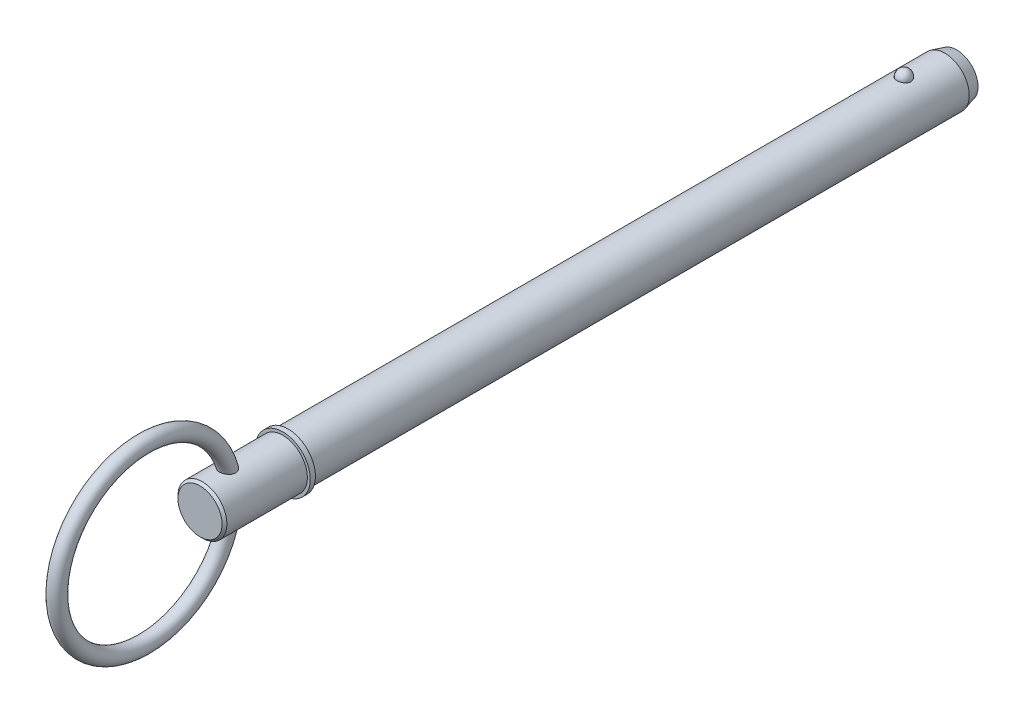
ISO-10303-21;
HEADER;
FILE_DESCRIPTION(('STEP AP214'),'2;1');
FILE_NAME('part.step','',(''),(''),'','','');
FILE_SCHEMA(('AUTOMOTIVE_DESIGN { 1 0 10303 214 1 1 1 1 }'));
ENDSEC;
DATA;
#1=APPLICATION_CONTEXT('core data for automotive mechanical design processes');
#2=APPLICATION_PROTOCOL_DEFINITION('international standard','automotive_design',2000,#1);
#3=PRODUCT_CONTEXT('',#1,'mechanical');
#4=PRODUCT('Part','Part','',(#3));
#5=PRODUCT_RELATED_PRODUCT_CATEGORY('part','',(#4));
#6=PRODUCT_DEFINITION_FORMATION('','',#4);
#7=PRODUCT_DEFINITION_CONTEXT('part definition',#1,'design');
#8=PRODUCT_DEFINITION('design','',#6,#7);
#9=PRODUCT_DEFINITION_SHAPE('','',#8);
#10=(LENGTH_UNIT() NAMED_UNIT(*) SI_UNIT(.MILLI.,.METRE.));
#11=(NAMED_UNIT(*) PLANE_ANGLE_UNIT() SI_UNIT($,.RADIAN.));
#12=(NAMED_UNIT(*) SI_UNIT($,.STERADIAN.) SOLID_ANGLE_UNIT());
#13=UNCERTAINTY_MEASURE_WITH_UNIT(LENGTH_MEASURE(1.E-05),#10,'distance_accuracy_value','');
#14=(GEOMETRIC_REPRESENTATION_CONTEXT(3) GLOBAL_UNCERTAINTY_ASSIGNED_CONTEXT((#13)) GLOBAL_UNIT_ASSIGNED_CONTEXT((#10,
#11,#12)) REPRESENTATION_CONTEXT('',''));
#15=CARTESIAN_POINT('',(0.,0.,0.));
#16=DIRECTION('',(0.,0.,1.));
#17=DIRECTION('',(1.,0.,0.));
#18=AXIS2_PLACEMENT_3D('',#15,#16,#17);
#19=CARTESIAN_POINT('',(0.,0.,177.8));
#20=DIRECTION('',(0.,0.,-1.));
#21=DIRECTION('',(-1.,0.,0.));
#22=AXIS2_PLACEMENT_3D('',#19,#20,#21);
#23=CYLINDRICAL_SURFACE('',#22,7.145);
#24=CARTESIAN_POINT('',(1.99971637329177,6.85945766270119,-2.02));
#25=CARTESIAN_POINT('',(1.9997145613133,6.85945924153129,-1.9070973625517));
#26=CARTESIAN_POINT('',(1.99051486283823,6.86216053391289,-1.79417185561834));
#27=CARTESIAN_POINT('',(1.95393597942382,6.87266409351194,-1.57152267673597));
#28=CARTESIAN_POINT('',(1.92655029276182,6.88046818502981,-1.46180016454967));
#29=CARTESIAN_POINT('',(1.85429435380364,6.90029063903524,-1.24873107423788));
#30=CARTESIAN_POINT('',(1.80943177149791,6.91230715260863,-1.14538172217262));
#31=CARTESIAN_POINT('',(1.70333474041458,6.93921158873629,-0.947875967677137));
#32=CARTESIAN_POINT('',(1.64210059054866,6.95409945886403,-0.853719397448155));
#33=CARTESIAN_POINT('',(1.5044381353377,6.98517577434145,-0.676721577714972));
#34=CARTESIAN_POINT('',(1.42793505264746,7.00137037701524,-0.593939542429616));
#35=CARTESIAN_POINT('',(1.26189697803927,7.03319066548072,-0.442536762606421));
#36=CARTESIAN_POINT('',(1.17236198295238,7.04881635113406,-0.373916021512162));
#37=CARTESIAN_POINT('',(0.982932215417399,7.0777121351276,-0.252935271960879));
#38=CARTESIAN_POINT('',(0.883068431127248,7.09098897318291,-0.200528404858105));
#39=CARTESIAN_POINT('',(0.675560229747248,7.11375589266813,-0.113212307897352));
#40=CARTESIAN_POINT('',(0.567916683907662,7.12324639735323,-0.0783011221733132));
#41=CARTESIAN_POINT('',(0.350006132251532,7.13724173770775,-0.0274707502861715));
#42=CARTESIAN_POINT('',(0.239822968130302,7.14183447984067,-0.0112162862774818));
#43=CARTESIAN_POINT('',(0.0181946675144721,7.14583597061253,0.00296794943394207));
#44=CARTESIAN_POINT('',(-0.0932503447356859,7.14524522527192,0.000899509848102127));
#45=CARTESIAN_POINT('',(-0.312527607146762,7.13899247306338,-0.0213331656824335));
#46=CARTESIAN_POINT('',(-0.420388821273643,7.13340426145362,-0.0412340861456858));
#47=CARTESIAN_POINT('',(-0.631141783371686,7.11785474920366,-0.0982040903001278));
#48=CARTESIAN_POINT('',(-0.734033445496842,7.10789337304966,-0.135273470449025));
#49=CARTESIAN_POINT('',(-0.932634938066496,7.08458058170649,-0.225826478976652));
#50=CARTESIAN_POINT('',(-1.02829911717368,7.07120963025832,-0.27940508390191));
#51=CARTESIAN_POINT('',(-1.20927180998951,7.04252043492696,-0.401457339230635));
#52=CARTESIAN_POINT('',(-1.29457925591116,7.02720199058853,-0.469932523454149));
#53=CARTESIAN_POINT('',(-1.45423311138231,6.995926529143,-0.621438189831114));
#54=CARTESIAN_POINT('',(-1.5283348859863,6.97996288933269,-0.7047251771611));
#55=CARTESIAN_POINT('',(-1.66169281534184,6.94942414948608,-0.882667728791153));
#56=CARTESIAN_POINT('',(-1.72094789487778,6.93484915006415,-0.977324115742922));
#57=CARTESIAN_POINT('',(-1.82375276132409,6.90853186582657,-1.17661373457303));
#58=CARTESIAN_POINT('',(-1.86711024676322,6.8968248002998,-1.28135093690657));
#59=CARTESIAN_POINT('',(-1.9360425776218,6.87779420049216,-1.49689986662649));
#60=CARTESIAN_POINT('',(-1.96161794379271,6.87047053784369,-1.60771141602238));
#61=CARTESIAN_POINT('',(-1.99427437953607,6.86106309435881,-1.83176258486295));
#62=CARTESIAN_POINT('',(-2.00143373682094,6.8589571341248,-1.9449898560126));
#63=CARTESIAN_POINT('',(-1.99730449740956,6.86016064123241,-2.17107603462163));
#64=CARTESIAN_POINT('',(-1.98601641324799,6.86346995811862,-2.28393495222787));
#65=CARTESIAN_POINT('',(-1.94538181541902,6.87509649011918,-2.5054843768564));
#66=CARTESIAN_POINT('',(-1.91612773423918,6.88338806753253,-2.61419321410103));
#67=CARTESIAN_POINT('',(-1.84036449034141,6.90402888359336,-2.82501243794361));
#68=CARTESIAN_POINT('',(-1.79385462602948,6.91637828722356,-2.92712255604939));
#69=CARTESIAN_POINT('',(-1.68442067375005,6.94384180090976,-3.12247704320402));
#70=CARTESIAN_POINT('',(-1.62140729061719,6.95897081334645,-3.21566929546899));
#71=CARTESIAN_POINT('',(-1.4806650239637,6.99026742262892,-3.38999412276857));
#72=CARTESIAN_POINT('',(-1.40293556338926,7.00643506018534,-3.47112622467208));
#73=CARTESIAN_POINT('',(-1.2344320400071,7.03807960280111,-3.61938672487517));
#74=CARTESIAN_POINT('',(-1.1436092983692,7.05355363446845,-3.68646046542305));
#75=CARTESIAN_POINT('',(-0.9515914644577,7.08201263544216,-3.80431973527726));
#76=CARTESIAN_POINT('',(-0.850397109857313,7.09499778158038,-3.85510642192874));
#77=CARTESIAN_POINT('',(-0.641823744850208,7.11687679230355,-3.93839532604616));
#78=CARTESIAN_POINT('',(-0.534539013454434,7.1258202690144,-3.9711204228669));
#79=CARTESIAN_POINT('',(-0.315743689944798,7.1388605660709,-4.01830716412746));
#80=CARTESIAN_POINT('',(-0.204233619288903,7.14295798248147,-4.03277105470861));
#81=CARTESIAN_POINT('',(0.0175518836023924,7.14582273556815,-4.04291389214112));
#82=CARTESIAN_POINT('',(0.127809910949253,7.14469090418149,-4.03894819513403));
#83=CARTESIAN_POINT('',(0.346044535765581,7.13745046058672,-4.01315850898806));
#84=CARTESIAN_POINT('',(0.454021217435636,7.13134203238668,-3.99133518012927));
#85=CARTESIAN_POINT('',(0.664227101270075,7.11483713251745,-3.93057164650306));
#86=CARTESIAN_POINT('',(0.766477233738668,7.10445761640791,-3.89169908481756));
#87=CARTESIAN_POINT('',(0.962929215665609,7.08050813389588,-3.79792023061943));
#88=CARTESIAN_POINT('',(1.05713054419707,7.06693796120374,-3.7430129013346));
#89=CARTESIAN_POINT('',(1.23644031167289,7.03780007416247,-3.61765173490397));
#90=CARTESIAN_POINT('',(1.32138387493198,7.0222044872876,-3.54696861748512));
#91=CARTESIAN_POINT('',(1.47830582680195,6.99085504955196,-3.39245228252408));
#92=CARTESIAN_POINT('',(1.55028198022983,6.97510117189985,-3.30861680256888));
#93=CARTESIAN_POINT('',(1.68063701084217,6.94485803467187,-3.12843058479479));
#94=CARTESIAN_POINT('',(1.73875175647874,6.93039619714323,-3.03188405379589));
#95=CARTESIAN_POINT('',(1.83823393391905,6.90467783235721,-2.83015210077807));
#96=CARTESIAN_POINT('',(1.87960712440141,6.89342020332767,-2.72496966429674));
#97=CARTESIAN_POINT('',(1.94111647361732,6.87633596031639,-2.52050234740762));
#98=CARTESIAN_POINT('',(1.96305249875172,6.87005682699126,-2.42179225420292));
#99=CARTESIAN_POINT('',(1.99235308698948,6.86161702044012,-2.22206084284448));
#100=CARTESIAN_POINT('',(1.99971799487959,6.85945624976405,-2.12103957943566));
#101=CARTESIAN_POINT('',(1.99971637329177,6.85945766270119,-2.02));
#102=B_SPLINE_CURVE_WITH_KNOTS('',3,(#24,#25,#26,#27,#28,#29,#30,#31,#32,#33,#34,#35,#36,#37,
#38,#39,#40,#41,#42,#43,#44,#45,#46,#47,#48,#49,#50,#51,#52,#53,#54,#55,#56,#57,#58,#59,#60,#61,
#62,#63,#64,#65,#66,#67,#68,#69,#70,#71,#72,#73,#74,#75,#76,#77,#78,#79,#80,#81,#82,#83,#84,#85,
#86,#87,#88,#89,#90,#91,#92,#93,#94,#95,#96,#97,#98,#99,#100,#101),.UNSPECIFIED.,.T.,.F.,(4,2,2,
2,2,2,2,2,2,2,2,2,2,2,2,2,2,2,2,2,2,2,2,2,2,2,2,2,2,2,2,2,2,2,2,2,2,2,4),(0.,0.338345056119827,
0.676811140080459,1.01512885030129,1.35344038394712,1.69345130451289,2.03346230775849,
2.37248128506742,2.71146235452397,3.04425125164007,3.37700766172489,3.70493009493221,
4.03285819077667,4.36270921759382,4.69259422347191,5.02887632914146,5.36518278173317,
5.70543263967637,6.04567253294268,6.38446363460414,6.72324532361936,7.06029846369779,
7.39736530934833,7.73629500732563,8.07523799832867,8.41547528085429,8.7556883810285,
9.09160363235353,9.42747756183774,9.75690239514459,10.0863150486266,10.4144324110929,
10.7425709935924,11.0758313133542,11.4091490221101,11.748385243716,12.0875046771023,
12.3903058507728,12.6930998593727),.UNSPECIFIED.);
#103=CARTESIAN_POINT('',(1.99971637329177,6.85945766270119,-2.02));
#104=VERTEX_POINT('',#103);
#105=EDGE_CURVE('E102',#104,#104,#102,.T.);
#106=ORIENTED_EDGE('',*,*,#105,.T.);
#107=EDGE_LOOP('',(#106));
#108=FACE_BOUND('',#107,.T.);
#109=CARTESIAN_POINT('',(0.,0.,-13.9499999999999));
#110=DIRECTION('',(0.,0.,-1.));
#111=DIRECTION('',(-1.,0.,0.));
#112=AXIS2_PLACEMENT_3D('',#109,#110,#111);
#113=CIRCLE('',#112,7.145);
#114=CARTESIAN_POINT('',(-7.145,0.,-13.9499999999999));
#115=VERTEX_POINT('',#114);
#116=EDGE_CURVE('E109',#115,#115,#113,.F.);
#117=ORIENTED_EDGE('',*,*,#116,.T.);
#118=EDGE_LOOP('',(#117));
#119=FACE_BOUND('',#118,.T.);
#120=CARTESIAN_POINT('',(0.,0.,177.8));
#121=DIRECTION('',(0.,0.,1.));
#122=DIRECTION('',(1.,0.,0.));
#123=AXIS2_PLACEMENT_3D('',#120,#121,#122);
#124=CIRCLE('',#123,7.145);
#125=CARTESIAN_POINT('',(7.145,0.,177.8));
#126=VERTEX_POINT('',#125);
#127=EDGE_CURVE('E107',#126,#126,#124,.T.);
#128=ORIENTED_EDGE('',*,*,#127,.F.);
#129=EDGE_LOOP('',(#128));
#130=FACE_BOUND('',#129,.T.);
#131=ADVANCED_FACE('F39',(#108,#119,#130),#23,.T.);
#132=CARTESIAN_POINT('',(0.,0.,-17.45));
#133=DIRECTION('',(0.,0.,-1.));
#134=DIRECTION('',(-1.,0.,0.));
#135=AXIS2_PLACEMENT_3D('',#132,#133,#134);
#136=PLANE('',#135);
#137=CARTESIAN_POINT('',(0.,0.,-17.45));
#138=DIRECTION('',(0.,0.,-1.));
#139=DIRECTION('',(-1.,0.,0.));
#140=AXIS2_PLACEMENT_3D('',#137,#138,#139);
#141=CIRCLE('',#140,6.20717782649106);
#142=CARTESIAN_POINT('',(-6.20717782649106,0.,-17.45));
#143=VERTEX_POINT('',#142);
#144=EDGE_CURVE('E142',#143,#143,#141,.T.);
#145=ORIENTED_EDGE('',*,*,#144,.T.);
#146=EDGE_LOOP('',(#145));
#147=FACE_BOUND('',#146,.T.);
#148=ADVANCED_FACE('F88',(#147),#136,.T.);
#149=CARTESIAN_POINT('',(0.,0.,-17.45));
#150=DIRECTION('',(0.,0.,1.));
#151=DIRECTION('',(1.,0.,0.));
#152=AXIS2_PLACEMENT_3D('',#149,#150,#151);
#153=CONICAL_SURFACE('',#152,6.20717782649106,0.261799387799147);
#154=ORIENTED_EDGE('',*,*,#116,.F.);
#155=EDGE_LOOP('',(#154));
#156=FACE_BOUND('',#155,.T.);
#157=ORIENTED_EDGE('',*,*,#144,.F.);
#158=EDGE_LOOP('',(#157));
#159=FACE_BOUND('',#158,.T.);
#160=ADVANCED_FACE('F94',(#156,#159),#153,.T.);
#161=CARTESIAN_POINT('',(0.,7.145,-2.02));
#162=DIRECTION('',(0.,1.,0.));
#163=DIRECTION('',(0.,0.,-1.));
#164=AXIS2_PLACEMENT_3D('',#161,#162,#163);
#165=SPHERICAL_SURFACE('',#164,2.02);
#166=ORIENTED_EDGE('',*,*,#105,.F.);
#167=EDGE_LOOP('',(#166));
#168=FACE_BOUND('',#167,.T.);
#169=ADVANCED_FACE('F112',(#168),#165,.T.);
#170=CARTESIAN_POINT('',(0.,0.,177.8));
#171=DIRECTION('',(0.,0.,-1.));
#172=DIRECTION('',(-1.,0.,0.));
#173=AXIS2_PLACEMENT_3D('',#170,#171,#172);
#174=PLANE('',#173);
#175=ORIENTED_EDGE('',*,*,#127,.T.);
#176=EDGE_LOOP('',(#175));
#177=FACE_BOUND('',#176,.T.);
#178=CARTESIAN_POINT('',(0.,0.,177.8));
#179=DIRECTION('',(0.,0.,-1.));
#180=DIRECTION('',(-1.,0.,0.));
#181=AXIS2_PLACEMENT_3D('',#178,#179,#180);
#182=CIRCLE('',#181,8.);
#183=CARTESIAN_POINT('',(-8.,0.,177.8));
#184=VERTEX_POINT('',#183);
#185=EDGE_CURVE('E108',#184,#184,#182,.T.);
#186=ORIENTED_EDGE('',*,*,#185,.T.);
#187=EDGE_LOOP('',(#186));
#188=FACE_BOUND('',#187,.T.);
#189=ADVANCED_FACE('F116',(#177,#188),#174,.T.);
#190=CARTESIAN_POINT('',(0.,0.,33.7287874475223));
#191=DIRECTION('',(0.,0.,-1.));
#192=DIRECTION('',(-1.,0.,0.));
#193=AXIS2_PLACEMENT_3D('',#190,#191,#192);
#194=CYLINDRICAL_SURFACE('',#193,8.);
#195=CARTESIAN_POINT('',(0.,0.,179.3));
#196=DIRECTION('',(0.,0.,-1.));
#197=DIRECTION('',(-1.,0.,0.));
#198=AXIS2_PLACEMENT_3D('',#195,#196,#197);
#199=CIRCLE('',#198,8.);
#200=CARTESIAN_POINT('',(-8.,0.,179.3));
#201=VERTEX_POINT('',#200);
#202=EDGE_CURVE('E133',#201,#201,#199,.T.);
#203=ORIENTED_EDGE('',*,*,#202,.T.);
#204=EDGE_LOOP('',(#203));
#205=FACE_BOUND('',#204,.T.);
#206=ORIENTED_EDGE('',*,*,#185,.F.);
#207=EDGE_LOOP('',(#206));
#208=FACE_BOUND('',#207,.T.);
#209=ADVANCED_FACE('F120',(#205,#208),#194,.T.);
#210=CARTESIAN_POINT('',(0.,8.,179.3));
#211=DIRECTION('',(0.,0.,1.));
#212=DIRECTION('',(1.,0.,0.));
#213=AXIS2_PLACEMENT_3D('',#210,#211,#212);
#214=PLANE('',#213);
#215=CARTESIAN_POINT('',(0.,0.,179.3));
#216=DIRECTION('',(0.,0.,1.));
#217=DIRECTION('',(1.,0.,0.));
#218=AXIS2_PLACEMENT_3D('',#215,#216,#217);
#219=CIRCLE('',#218,7.145);
#220=CARTESIAN_POINT('',(7.145,0.,179.3));
#221=VERTEX_POINT('',#220);
#222=EDGE_CURVE('E111',#221,#221,#219,.T.);
#223=ORIENTED_EDGE('',*,*,#222,.F.);
#224=EDGE_LOOP('',(#223));
#225=FACE_BOUND('',#224,.T.);
#226=ORIENTED_EDGE('',*,*,#202,.F.);
#227=EDGE_LOOP('',(#226));
#228=FACE_BOUND('',#227,.T.);
#229=ADVANCED_FACE('F85',(#225,#228),#214,.T.);
#230=CARTESIAN_POINT('',(0.,0.,203.5));
#231=DIRECTION('',(0.,0.,-1.));
#232=DIRECTION('',(-1.,0.,0.));
#233=AXIS2_PLACEMENT_3D('',#230,#231,#232);
#234=CYLINDRICAL_SURFACE('',#233,7.145);
#235=CARTESIAN_POINT('',(-1.03551034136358,-7.0695645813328,193.430259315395));
#236=CARTESIAN_POINT('',(-0.923225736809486,-7.08601142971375,193.374402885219));
#237=CARTESIAN_POINT('',(-0.806039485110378,-7.10042113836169,193.327835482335));
#238=CARTESIAN_POINT('',(-0.565173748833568,-7.1236385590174,193.254279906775));
#239=CARTESIAN_POINT('',(-0.441495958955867,-7.13244772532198,193.227286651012));
#240=CARTESIAN_POINT('',(-0.191106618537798,-7.14354309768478,193.193450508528));
#241=CARTESIAN_POINT('',(-0.0643945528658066,-7.14582818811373,193.186611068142));
#242=CARTESIAN_POINT('',(0.18844338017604,-7.14363337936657,193.193241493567));
#243=CARTESIAN_POINT('',(0.314569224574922,-7.13915321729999,193.206712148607));
#244=CARTESIAN_POINT('',(0.562499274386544,-7.12390574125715,193.25364165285));
#245=CARTESIAN_POINT('',(0.684308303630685,-7.11314569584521,193.287077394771));
#246=CARTESIAN_POINT('',(0.920329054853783,-7.08647538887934,193.373194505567));
#247=CARTESIAN_POINT('',(1.0345403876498,-7.07056486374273,193.425876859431));
#248=CARTESIAN_POINT('',(1.2523263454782,-7.03526161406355,193.5494470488));
#249=CARTESIAN_POINT('',(1.35588248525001,-7.01586299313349,193.62036580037));
#250=CARTESIAN_POINT('',(1.54916093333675,-6.9757352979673,193.778757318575));
#251=CARTESIAN_POINT('',(1.63888414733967,-6.95500631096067,193.866229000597));
#252=CARTESIAN_POINT('',(1.80113983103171,-6.91475703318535,194.054727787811));
#253=CARTESIAN_POINT('',(1.87381924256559,-6.89522757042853,194.155626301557));
#254=CARTESIAN_POINT('',(2.00091178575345,-6.8594283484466,194.36884010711));
#255=CARTESIAN_POINT('',(2.05532963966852,-6.8431577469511,194.481152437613));
#256=CARTESIAN_POINT('',(2.14350100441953,-6.81604873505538,194.711194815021));
#257=CARTESIAN_POINT('',(2.17770329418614,-6.80509340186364,194.828739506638));
#258=CARTESIAN_POINT('',(2.22691394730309,-6.7891497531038,195.068149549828));
#259=CARTESIAN_POINT('',(2.2419216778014,-6.7841616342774,195.190015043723));
#260=CARTESIAN_POINT('',(2.25313992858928,-6.78044381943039,195.43580699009));
#261=CARTESIAN_POINT('',(2.24917302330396,-6.78177319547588,195.559742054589));
#262=CARTESIAN_POINT('',(2.22301329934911,-6.79039131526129,195.805438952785));
#263=CARTESIAN_POINT('',(2.20081491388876,-6.79768187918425,195.9272001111));
#264=CARTESIAN_POINT('',(2.13702421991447,-6.81801706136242,196.175287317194));
#265=CARTESIAN_POINT('',(2.09404815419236,-6.83146790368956,196.301223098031));
#266=CARTESIAN_POINT('',(1.98986384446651,-6.86253672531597,196.544824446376));
#267=CARTESIAN_POINT('',(1.92864130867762,-6.88015796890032,196.662483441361));
#268=CARTESIAN_POINT('',(1.7827436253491,-6.91947130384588,196.897497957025));
#269=CARTESIAN_POINT('',(1.6964070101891,-6.94139021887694,197.013789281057));
#270=CARTESIAN_POINT('',(1.50503944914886,-6.98537683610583,197.229799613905));
#271=CARTESIAN_POINT('',(1.40001969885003,-7.00744444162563,197.329528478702));
#272=CARTESIAN_POINT('',(1.19221781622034,-7.04548349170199,197.493170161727));
#273=CARTESIAN_POINT('',(1.09203347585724,-7.06185586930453,197.56028599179));
#274=CARTESIAN_POINT('',(0.88160718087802,-7.09119477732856,197.677337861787));
#275=CARTESIAN_POINT('',(0.771372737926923,-7.10416382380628,197.727286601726));
#276=CARTESIAN_POINT('',(0.542622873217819,-7.12529560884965,197.807475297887));
#277=CARTESIAN_POINT('',(0.424058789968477,-7.13342692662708,197.83758654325));
#278=CARTESIAN_POINT('',(0.183155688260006,-7.14366628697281,197.875370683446));
#279=CARTESIAN_POINT('',(0.0608191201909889,-7.14577815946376,197.883057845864));
#280=CARTESIAN_POINT('',(-0.169367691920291,-7.14381572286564,197.875860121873));
#281=CARTESIAN_POINT('',(-0.277308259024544,-7.14040669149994,197.863402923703));
#282=CARTESIAN_POINT('',(-0.489468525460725,-7.12900651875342,197.821156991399));
#283=CARTESIAN_POINT('',(-0.593687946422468,-7.12101503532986,197.791366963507));
#284=CARTESIAN_POINT('',(-0.796149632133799,-7.10123695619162,197.715987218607));
#285=CARTESIAN_POINT('',(-0.894373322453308,-7.08943921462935,197.670351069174));
#286=CARTESIAN_POINT('',(-1.08274371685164,-7.06312621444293,197.565336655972));
#287=CARTESIAN_POINT('',(-1.17288754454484,-7.04860999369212,197.505953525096));
#288=CARTESIAN_POINT('',(-1.35484961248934,-7.01605385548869,197.367113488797));
#289=CARTESIAN_POINT('',(-1.44541008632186,-6.99780069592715,197.286061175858));
#290=CARTESIAN_POINT('',(-1.61364655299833,-6.96093393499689,197.111599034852));
#291=CARTESIAN_POINT('',(-1.69131381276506,-6.94232009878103,197.018180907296));
#292=CARTESIAN_POINT('',(-1.84330074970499,-6.90364386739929,196.806608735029));
#293=CARTESIAN_POINT('',(-1.91543090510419,-6.88377370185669,196.686839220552));
#294=CARTESIAN_POINT('',(-2.04002946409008,-6.84788436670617,196.436875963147));
#295=CARTESIAN_POINT('',(-2.09248830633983,-6.83186707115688,196.306677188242));
#296=CARTESIAN_POINT('',(-2.17795964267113,-6.80511869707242,196.032555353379));
#297=CARTESIAN_POINT('',(-2.20992909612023,-6.79467512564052,195.888274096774));
#298=CARTESIAN_POINT('',(-2.24813111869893,-6.78213595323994,195.595984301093));
#299=CARTESIAN_POINT('',(-2.25438316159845,-6.78003403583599,195.447978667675));
#300=CARTESIAN_POINT('',(-2.24011368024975,-6.78475868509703,195.165430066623));
#301=CARTESIAN_POINT('',(-2.22172362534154,-6.79087455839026,195.030769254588));
#302=CARTESIAN_POINT('',(-2.16145328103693,-6.81029672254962,194.767367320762));
#303=CARTESIAN_POINT('',(-2.11958615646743,-6.82359898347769,194.638622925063));
#304=CARTESIAN_POINT('',(-2.01784121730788,-6.85433303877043,194.402267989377));
#305=CARTESIAN_POINT('',(-1.9598239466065,-6.8713108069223,194.293792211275));
#306=CARTESIAN_POINT('',(-1.82642155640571,-6.90796511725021,194.088591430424));
#307=CARTESIAN_POINT('',(-1.75103235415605,-6.92764229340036,193.991869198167));
#308=CARTESIAN_POINT('',(-1.57825515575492,-6.96911949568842,193.805408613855));
#309=CARTESIAN_POINT('',(-1.47957996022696,-6.9909623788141,193.71687037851));
#310=CARTESIAN_POINT('',(-1.26760341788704,-7.0324852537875,193.558840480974));
#311=CARTESIAN_POINT('',(-1.15429989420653,-7.05216492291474,193.489351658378));
#312=CARTESIAN_POINT('',(-1.03551034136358,-7.0695645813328,193.430259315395));
#313=B_SPLINE_CURVE_WITH_KNOTS('',3,(#235,#236,#237,#238,#239,#240,#241,#242,#243,#244,#245,
#246,#247,#248,#249,#250,#251,#252,#253,#254,#255,#256,#257,#258,#259,#260,#261,#262,#263,#264,
#265,#266,#267,#268,#269,#270,#271,#272,#273,#274,#275,#276,#277,#278,#279,#280,#281,#282,#283,
#284,#285,#286,#287,#288,#289,#290,#291,#292,#293,#294,#295,#296,#297,#298,#299,#300,#301,#302,
#303,#304,#305,#306,#307,#308,#309,#310,#311,#312),.UNSPECIFIED.,.T.,.F.,(4,2,2,2,2,2,2,2,2,2,2,
2,2,2,2,2,2,2,2,2,2,2,2,2,2,2,2,2,2,2,2,2,2,2,2,2,2,2,4),(0.,0.378979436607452,
0.757860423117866,1.13680619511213,1.51576669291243,1.89428943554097,2.27283155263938,
2.65201969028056,3.03118299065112,3.40694616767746,3.78261210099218,4.14959041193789,
4.51658082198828,4.88700951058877,5.25755134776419,5.65713708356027,6.05703662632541,
6.49445595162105,6.93161403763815,7.29520224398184,7.65852089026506,8.02417421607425,
8.38959483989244,8.71415763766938,9.03874466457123,9.36429093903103,9.68995264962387,
10.0572255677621,10.4247462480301,10.8465602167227,11.2685789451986,11.7106604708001,
12.152407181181,12.5583067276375,12.9639788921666,13.3347314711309,13.7055712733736,
14.1064462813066,14.5073810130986),.UNSPECIFIED.);
#314=CARTESIAN_POINT('',(-1.03551034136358,-7.0695645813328,193.430259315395));
#315=VERTEX_POINT('',#314);
#316=EDGE_CURVE('E10',#315,#315,#313,.T.);
#317=ORIENTED_EDGE('',*,*,#316,.F.);
#318=EDGE_LOOP('',(#317));
#319=FACE_BOUND('',#318,.T.);
#320=CARTESIAN_POINT('',(-1.03551034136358,7.0695645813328,193.430259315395));
#321=CARTESIAN_POINT('',(-1.14644953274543,7.05331457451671,193.485446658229));
#322=CARTESIAN_POINT('',(-1.25260902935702,7.03507806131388,193.549702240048));
#323=CARTESIAN_POINT('',(-1.45240021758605,6.99656564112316,193.694958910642));
#324=CARTESIAN_POINT('',(-1.54602879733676,6.97628922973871,193.775964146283));
#325=CARTESIAN_POINT('',(-1.71815091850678,6.93590796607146,193.952910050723));
#326=CARTESIAN_POINT('',(-1.79663177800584,6.91580327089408,194.048863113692));
#327=CARTESIAN_POINT('',(-1.93607718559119,6.87807159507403,194.253162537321));
#328=CARTESIAN_POINT('',(-1.99704642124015,6.86044395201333,194.361505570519));
#329=CARTESIAN_POINT('',(-2.09894945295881,6.82995115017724,194.585542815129));
#330=CARTESIAN_POINT('',(-2.1402125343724,6.81700866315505,194.701076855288));
#331=CARTESIAN_POINT('',(-2.20347311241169,6.79682602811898,194.937758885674));
#332=CARTESIAN_POINT('',(-2.22547114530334,6.78958572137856,195.058906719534));
#333=CARTESIAN_POINT('',(-2.25026114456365,6.78140983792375,195.303214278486));
#334=CARTESIAN_POINT('',(-2.25306986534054,6.78046876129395,195.42637215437));
#335=CARTESIAN_POINT('',(-2.2403056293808,6.78469532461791,195.671604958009));
#336=CARTESIAN_POINT('',(-2.22472720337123,6.78986478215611,195.793679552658));
#337=CARTESIAN_POINT('',(-2.17472134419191,6.8060520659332,196.042036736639));
#338=CARTESIAN_POINT('',(-2.13910164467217,6.81743831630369,196.168053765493));
#339=CARTESIAN_POINT('',(-2.04975058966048,6.84483151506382,196.412973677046));
#340=CARTESIAN_POINT('',(-1.99600968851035,6.86084089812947,196.531872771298));
#341=CARTESIAN_POINT('',(-1.86558545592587,6.8975101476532,196.771425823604));
#342=CARTESIAN_POINT('',(-1.78715729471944,6.91847353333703,196.891087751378));
#343=CARTESIAN_POINT('',(-1.61149373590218,6.96148580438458,197.115646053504));
#344=CARTESIAN_POINT('',(-1.51424701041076,6.98353533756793,197.22053346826));
#345=CARTESIAN_POINT('',(-1.30107590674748,7.02639179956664,197.412951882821));
#346=CARTESIAN_POINT('',(-1.18492282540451,7.04717858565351,197.500236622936));
#347=CARTESIAN_POINT('',(-0.937392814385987,7.08434208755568,197.650827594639));
#348=CARTESIAN_POINT('',(-0.806039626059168,7.10072555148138,197.714170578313));
#349=CARTESIAN_POINT('',(-0.550470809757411,7.12475629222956,197.805483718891));
#350=CARTESIAN_POINT('',(-0.427643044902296,7.13327781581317,197.837047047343));
#351=CARTESIAN_POINT('',(-0.240556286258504,7.14122488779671,197.866356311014));
#352=CARTESIAN_POINT('',(-0.177714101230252,7.14306799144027,197.873119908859));
#353=CARTESIAN_POINT('',(-0.051647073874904,7.14509121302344,197.880539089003));
#354=CARTESIAN_POINT('',(0.0115777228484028,7.14527152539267,197.881195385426));
#355=CARTESIAN_POINT('',(0.182932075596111,7.14347436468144,197.874616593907));
#356=CARTESIAN_POINT('',(0.290871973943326,7.13986325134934,197.861408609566));
#357=CARTESIAN_POINT('',(0.502842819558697,7.1280769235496,197.817690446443));
#358=CARTESIAN_POINT('',(0.606873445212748,7.11990133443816,197.787178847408));
#359=CARTESIAN_POINT('',(0.809001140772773,7.09978218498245,197.710378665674));
#360=CARTESIAN_POINT('',(0.907071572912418,7.08782300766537,197.664024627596));
#361=CARTESIAN_POINT('',(1.09503957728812,7.0612282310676,197.557620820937));
#362=CARTESIAN_POINT('',(1.18493426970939,7.04659169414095,197.497566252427));
#363=CARTESIAN_POINT('',(1.36644041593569,7.01380352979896,197.357233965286));
#364=CARTESIAN_POINT('',(1.45676563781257,6.99544216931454,197.275344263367));
#365=CARTESIAN_POINT('',(1.62440639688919,6.95842750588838,197.099231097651));
#366=CARTESIAN_POINT('',(1.701712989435,6.93977401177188,197.004999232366));
#367=CARTESIAN_POINT('',(1.85271606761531,6.90111647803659,196.791807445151));
#368=CARTESIAN_POINT('',(1.92421731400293,6.88131605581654,196.671248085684));
#369=CARTESIAN_POINT('',(2.04739198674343,6.84567995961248,196.419785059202));
#370=CARTESIAN_POINT('',(2.09905621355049,6.82984612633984,196.288876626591));
#371=CARTESIAN_POINT('',(2.18257767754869,6.80363167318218,196.013847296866));
#372=CARTESIAN_POINT('',(2.21345394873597,6.79352430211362,195.869397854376));
#373=CARTESIAN_POINT('',(2.24941288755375,6.78170753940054,195.576984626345));
#374=CARTESIAN_POINT('',(2.2545156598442,6.77999160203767,195.429023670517));
#375=CARTESIAN_POINT('',(2.2380435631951,6.78544298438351,195.147053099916));
#376=CARTESIAN_POINT('',(2.21864521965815,6.79188566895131,195.012903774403));
#377=CARTESIAN_POINT('',(2.1564876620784,6.81187529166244,194.750690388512));
#378=CARTESIAN_POINT('',(2.11373989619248,6.82541874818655,194.62262337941));
#379=CARTESIAN_POINT('',(2.01040099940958,6.85652522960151,194.387507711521));
#380=CARTESIAN_POINT('',(1.95162600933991,6.87365110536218,194.279597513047));
#381=CARTESIAN_POINT('',(1.81683142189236,6.91050025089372,194.075649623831));
#382=CARTESIAN_POINT('',(1.74081238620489,6.93022343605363,193.979611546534));
#383=CARTESIAN_POINT('',(1.57431234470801,6.96992220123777,193.80254183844));
#384=CARTESIAN_POINT('',(1.48394688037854,6.98989467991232,193.721400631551));
#385=CARTESIAN_POINT('',(1.29081365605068,7.02812243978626,193.575038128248));
#386=CARTESIAN_POINT('',(1.18804491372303,7.04637758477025,193.509818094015));
#387=CARTESIAN_POINT('',(0.970386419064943,7.07967210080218,193.395377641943));
#388=CARTESIAN_POINT('',(0.855272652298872,7.09462807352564,193.346558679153));
#389=CARTESIAN_POINT('',(0.618143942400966,7.11920826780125,193.268071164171));
#390=CARTESIAN_POINT('',(0.496128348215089,7.12883198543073,193.238404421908));
#391=CARTESIAN_POINT('',(0.247581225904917,7.14180209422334,193.198698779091));
#392=CARTESIAN_POINT('',(0.121020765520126,7.14509609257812,193.188823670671));
#393=CARTESIAN_POINT('',(-0.132022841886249,7.14489967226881,193.189415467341));
#394=CARTESIAN_POINT('',(-0.2585060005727,7.14141109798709,193.199876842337));
#395=CARTESIAN_POINT('',(-0.496649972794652,7.12862600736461,193.239053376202));
#396=CARTESIAN_POINT('',(-0.608625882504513,7.11987587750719,193.266055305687));
#397=CARTESIAN_POINT('',(-0.826925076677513,7.09783467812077,193.336222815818));
#398=CARTESIAN_POINT('',(-0.933248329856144,7.08454358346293,193.379388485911));
#399=CARTESIAN_POINT('',(-1.03551034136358,7.0695645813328,193.430259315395));
#400=B_SPLINE_CURVE_WITH_KNOTS('',3,(#320,#321,#322,#323,#324,#325,#326,#327,#328,#329,#330,
#331,#332,#333,#334,#335,#336,#337,#338,#339,#340,#341,#342,#343,#344,#345,#346,#347,#348,#349,
#350,#351,#352,#353,#354,#355,#356,#357,#358,#359,#360,#361,#362,#363,#364,#365,#366,#367,#368,
#369,#370,#371,#372,#373,#374,#375,#376,#377,#378,#379,#380,#381,#382,#383,#384,#385,#386,#387,
#388,#389,#390,#391,#392,#393,#394,#395,#396,#397,#398,#399),.UNSPECIFIED.,.T.,.F.,(4,2,2,2,2,2,
2,2,2,2,2,2,2,2,2,2,2,2,2,2,2,2,2,2,2,2,2,2,2,2,2,2,2,2,2,2,2,2,2,4),(0.,0.374504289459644,
0.7491014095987,1.12401080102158,1.49881974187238,1.86712525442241,2.23542051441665,
2.60339417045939,2.97147730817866,3.36420696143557,3.75714381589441,4.18898920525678,
4.62109535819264,5.0588812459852,5.49599234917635,5.87475353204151,6.06416800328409,
6.25356032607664,6.57826179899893,6.90298992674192,7.22907626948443,7.55527703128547,
7.92373585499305,8.29244681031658,8.71527472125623,9.13829848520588,9.58009907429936,
10.0215549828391,10.4264139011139,10.831074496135,11.2014904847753,11.571894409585,
11.9394538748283,12.3070424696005,12.6830655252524,13.0591241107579,13.4382822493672,
13.8173372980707,14.1625475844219,14.5077597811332),.UNSPECIFIED.);
#401=CARTESIAN_POINT('',(-1.03551034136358,7.0695645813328,193.430259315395));
#402=VERTEX_POINT('',#401);
#403=EDGE_CURVE('E51',#402,#402,#400,.T.);
#404=ORIENTED_EDGE('',*,*,#403,.F.);
#405=EDGE_LOOP('',(#404));
#406=FACE_BOUND('',#405,.T.);
#407=CARTESIAN_POINT('',(0.,0.,202.8));
#408=DIRECTION('',(0.,0.,-1.));
#409=DIRECTION('',(-1.,0.,0.));
#410=AXIS2_PLACEMENT_3D('',#407,#408,#409);
#411=CIRCLE('',#410,7.145);
#412=CARTESIAN_POINT('',(-7.145,0.,202.8));
#413=VERTEX_POINT('',#412);
#414=EDGE_CURVE('E64',#413,#413,#411,.T.);
#415=ORIENTED_EDGE('',*,*,#414,.T.);
#416=EDGE_LOOP('',(#415));
#417=FACE_BOUND('',#416,.T.);
#418=ORIENTED_EDGE('',*,*,#222,.T.);
#419=EDGE_LOOP('',(#418));
#420=FACE_BOUND('',#419,.T.);
#421=ADVANCED_FACE('F69',(#319,#406,#417,#420),#234,.T.);
#422=CARTESIAN_POINT('',(0.,0.,203.5));
#423=DIRECTION('',(0.,0.,-1.));
#424=DIRECTION('',(-1.,0.,0.));
#425=AXIS2_PLACEMENT_3D('',#422,#423,#424);
#426=PLANE('',#425);
#427=CARTESIAN_POINT('',(0.,0.,203.5));
#428=DIRECTION('',(0.,0.,-1.));
#429=DIRECTION('',(-1.,0.,0.));
#430=AXIS2_PLACEMENT_3D('',#427,#428,#429);
#431=CIRCLE('',#430,6.44499999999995);
#432=CARTESIAN_POINT('',(-6.44499999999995,0.,203.5));
#433=VERTEX_POINT('',#432);
#434=EDGE_CURVE('E58',#433,#433,#431,.F.);
#435=ORIENTED_EDGE('',*,*,#434,.T.);
#436=EDGE_LOOP('',(#435));
#437=FACE_BOUND('',#436,.T.);
#438=ADVANCED_FACE('F76',(#437),#426,.F.);
#439=CARTESIAN_POINT('',(0.,0.,202.8));
#440=DIRECTION('',(0.,0.,-1.));
#441=DIRECTION('',(-1.,0.,0.));
#442=AXIS2_PLACEMENT_3D('',#439,#440,#441);
#443=CONICAL_SURFACE('',#442,7.145,0.78539816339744);
#444=ORIENTED_EDGE('',*,*,#434,.F.);
#445=EDGE_LOOP('',(#444));
#446=FACE_BOUND('',#445,.T.);
#447=ORIENTED_EDGE('',*,*,#414,.F.);
#448=EDGE_LOOP('',(#447));
#449=FACE_BOUND('',#448,.T.);
#450=ADVANCED_FACE('F41',(#446,#449),#443,.T.);
#451=CARTESIAN_POINT('',(0.,0.,219.9));
#452=DIRECTION('',(1.,0.,0.));
#453=DIRECTION('',(0.,0.,-1.));
#454=AXIS2_PLACEMENT_3D('',#451,#452,#453);
#455=TOROIDAL_SURFACE('',#454,25.4,2.25);
#456=ORIENTED_EDGE('',*,*,#316,.T.);
#457=EDGE_LOOP('',(#456));
#458=FACE_BOUND('',#457,.T.);
#459=ORIENTED_EDGE('',*,*,#403,.T.);
#460=EDGE_LOOP('',(#459));
#461=FACE_BOUND('',#460,.T.);
#462=ADVANCED_FACE('F73',(#458,#461),#455,.T.);
#463=CLOSED_SHELL('',(#131,#148,#160,#169,#189,#209,#229,#421,#438,#450,#462));
#464=MANIFOLD_SOLID_BREP('B2',#463);
#465=ADVANCED_BREP_SHAPE_REPRESENTATION('',(#18,#464),#14);
#466=SHAPE_DEFINITION_REPRESENTATION(#9,#465);
ENDSEC;
END-ISO-10303-21;
